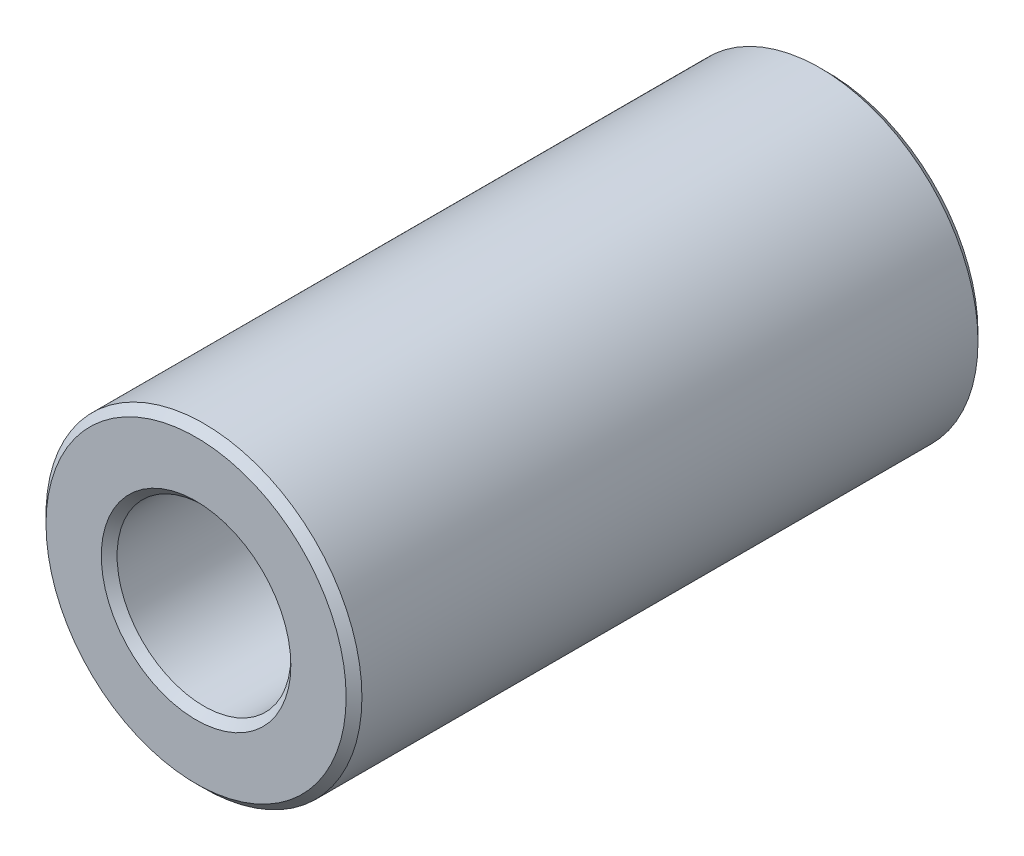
ISO-10303-21;
HEADER;
FILE_DESCRIPTION(('STEP AP214'),'2;1');
FILE_NAME('part.step','',(''),(''),'','','');
FILE_SCHEMA(('AUTOMOTIVE_DESIGN { 1 0 10303 214 1 1 1 1 }'));
ENDSEC;
DATA;
#1=APPLICATION_CONTEXT('core data for automotive mechanical design processes');
#2=APPLICATION_PROTOCOL_DEFINITION('international standard','automotive_design',2000,#1);
#3=PRODUCT_CONTEXT('',#1,'mechanical');
#4=PRODUCT('Part','Part','',(#3));
#5=PRODUCT_RELATED_PRODUCT_CATEGORY('part','',(#4));
#6=PRODUCT_DEFINITION_FORMATION('','',#4);
#7=PRODUCT_DEFINITION_CONTEXT('part definition',#1,'design');
#8=PRODUCT_DEFINITION('design','',#6,#7);
#9=PRODUCT_DEFINITION_SHAPE('','',#8);
#10=(LENGTH_UNIT() NAMED_UNIT(*) SI_UNIT(.MILLI.,.METRE.));
#11=(NAMED_UNIT(*) PLANE_ANGLE_UNIT() SI_UNIT($,.RADIAN.));
#12=(NAMED_UNIT(*) SI_UNIT($,.STERADIAN.) SOLID_ANGLE_UNIT());
#13=UNCERTAINTY_MEASURE_WITH_UNIT(LENGTH_MEASURE(1.E-05),#10,'distance_accuracy_value','');
#14=(GEOMETRIC_REPRESENTATION_CONTEXT(3) GLOBAL_UNCERTAINTY_ASSIGNED_CONTEXT((#13)) GLOBAL_UNIT_ASSIGNED_CONTEXT((#10,
#11,#12)) REPRESENTATION_CONTEXT('',''));
#15=CARTESIAN_POINT('',(0.,0.,0.));
#16=DIRECTION('',(0.,0.,1.));
#17=DIRECTION('',(1.,0.,0.));
#18=AXIS2_PLACEMENT_3D('',#15,#16,#17);
#19=CARTESIAN_POINT('',(0.,0.,4.));
#20=DIRECTION('',(0.,0.,1.));
#21=DIRECTION('',(1.,0.,0.));
#22=AXIS2_PLACEMENT_3D('',#19,#20,#21);
#23=PLANE('',#22);
#24=CARTESIAN_POINT('',(0.,0.,4.));
#25=DIRECTION('',(0.,0.,1.));
#26=DIRECTION('',(1.,0.,0.));
#27=AXIS2_PLACEMENT_3D('',#24,#25,#26);
#28=CIRCLE('',#27,1.2);
#29=CARTESIAN_POINT('',(1.2,0.,4.));
#30=VERTEX_POINT('',#29);
#31=EDGE_CURVE('E10',#30,#30,#28,.F.);
#32=ORIENTED_EDGE('',*,*,#31,.T.);
#33=EDGE_LOOP('',(#32));
#34=FACE_BOUND('',#33,.T.);
#35=CARTESIAN_POINT('',(0.,0.,4.));
#36=DIRECTION('',(0.,0.,1.));
#37=DIRECTION('',(1.,0.,0.));
#38=AXIS2_PLACEMENT_3D('',#35,#36,#37);
#39=CIRCLE('',#38,1.9);
#40=CARTESIAN_POINT('',(1.9,0.,4.));
#41=VERTEX_POINT('',#40);
#42=EDGE_CURVE('E45',#41,#41,#39,.T.);
#43=ORIENTED_EDGE('',*,*,#42,.T.);
#44=EDGE_LOOP('',(#43));
#45=FACE_BOUND('',#44,.T.);
#46=ADVANCED_FACE('F37',(#34,#45),#23,.T.);
#47=CARTESIAN_POINT('',(0.,0.,-4.));
#48=DIRECTION('',(0.,0.,1.));
#49=DIRECTION('',(1.,0.,0.));
#50=AXIS2_PLACEMENT_3D('',#47,#48,#49);
#51=PLANE('',#50);
#52=CARTESIAN_POINT('',(0.,0.,-4.));
#53=DIRECTION('',(0.,0.,1.));
#54=DIRECTION('',(1.,0.,0.));
#55=AXIS2_PLACEMENT_3D('',#52,#53,#54);
#56=CIRCLE('',#55,1.9);
#57=CARTESIAN_POINT('',(1.9,0.,-4.));
#58=VERTEX_POINT('',#57);
#59=EDGE_CURVE('E62',#58,#58,#56,.F.);
#60=ORIENTED_EDGE('',*,*,#59,.T.);
#61=EDGE_LOOP('',(#60));
#62=FACE_BOUND('',#61,.T.);
#63=CARTESIAN_POINT('',(0.,0.,-4.));
#64=DIRECTION('',(0.,0.,1.));
#65=DIRECTION('',(1.,0.,0.));
#66=AXIS2_PLACEMENT_3D('',#63,#64,#65);
#67=CIRCLE('',#66,1.2);
#68=CARTESIAN_POINT('',(1.2,0.,-4.));
#69=VERTEX_POINT('',#68);
#70=EDGE_CURVE('E66',#69,#69,#67,.T.);
#71=ORIENTED_EDGE('',*,*,#70,.T.);
#72=EDGE_LOOP('',(#71));
#73=FACE_BOUND('',#72,.T.);
#74=ADVANCED_FACE('F89',(#62,#73),#51,.F.);
#75=CARTESIAN_POINT('',(0.,0.,4.));
#76=DIRECTION('',(0.,0.,-1.));
#77=DIRECTION('',(-1.,0.,0.));
#78=AXIS2_PLACEMENT_3D('',#75,#76,#77);
#79=CYLINDRICAL_SURFACE('',#78,2.);
#80=CARTESIAN_POINT('',(0.,0.,-3.9));
#81=DIRECTION('',(0.,0.,1.));
#82=DIRECTION('',(1.,0.,0.));
#83=AXIS2_PLACEMENT_3D('',#80,#81,#82);
#84=CIRCLE('',#83,2.);
#85=CARTESIAN_POINT('',(2.,0.,-3.9));
#86=VERTEX_POINT('',#85);
#87=EDGE_CURVE('E70',#86,#86,#84,.T.);
#88=ORIENTED_EDGE('',*,*,#87,.T.);
#89=EDGE_LOOP('',(#88));
#90=FACE_BOUND('',#89,.T.);
#91=CARTESIAN_POINT('',(0.,0.,3.9));
#92=DIRECTION('',(0.,0.,1.));
#93=DIRECTION('',(1.,0.,0.));
#94=AXIS2_PLACEMENT_3D('',#91,#92,#93);
#95=CIRCLE('',#94,2.);
#96=CARTESIAN_POINT('',(2.,0.,3.9));
#97=VERTEX_POINT('',#96);
#98=EDGE_CURVE('E74',#97,#97,#95,.F.);
#99=ORIENTED_EDGE('',*,*,#98,.T.);
#100=EDGE_LOOP('',(#99));
#101=FACE_BOUND('',#100,.T.);
#102=ADVANCED_FACE('F78',(#90,#101),#79,.T.);
#103=CARTESIAN_POINT('',(0.,0.,4.));
#104=DIRECTION('',(0.,0.,-1.));
#105=DIRECTION('',(-1.,0.,0.));
#106=AXIS2_PLACEMENT_3D('',#103,#104,#105);
#107=CYLINDRICAL_SURFACE('',#106,1.1);
#108=CARTESIAN_POINT('',(0.,0.,-3.9));
#109=DIRECTION('',(0.,0.,1.));
#110=DIRECTION('',(1.,0.,0.));
#111=AXIS2_PLACEMENT_3D('',#108,#109,#110);
#112=CIRCLE('',#111,1.1);
#113=CARTESIAN_POINT('',(1.1,0.,-3.9));
#114=VERTEX_POINT('',#113);
#115=EDGE_CURVE('E51',#114,#114,#112,.F.);
#116=ORIENTED_EDGE('',*,*,#115,.T.);
#117=EDGE_LOOP('',(#116));
#118=FACE_BOUND('',#117,.T.);
#119=CARTESIAN_POINT('',(0.,0.,3.9));
#120=DIRECTION('',(0.,0.,1.));
#121=DIRECTION('',(1.,0.,0.));
#122=AXIS2_PLACEMENT_3D('',#119,#120,#121);
#123=CIRCLE('',#122,1.1);
#124=CARTESIAN_POINT('',(1.1,0.,3.9));
#125=VERTEX_POINT('',#124);
#126=EDGE_CURVE('E57',#125,#125,#123,.T.);
#127=ORIENTED_EDGE('',*,*,#126,.T.);
#128=EDGE_LOOP('',(#127));
#129=FACE_BOUND('',#128,.T.);
#130=ADVANCED_FACE('F97',(#118,#129),#107,.F.);
#131=CARTESIAN_POINT('',(0.,0.,-3.9));
#132=DIRECTION('',(0.,0.,1.));
#133=DIRECTION('',(1.,0.,0.));
#134=AXIS2_PLACEMENT_3D('',#131,#132,#133);
#135=CONICAL_SURFACE('',#134,2.,0.785398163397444);
#136=ORIENTED_EDGE('',*,*,#59,.F.);
#137=EDGE_LOOP('',(#136));
#138=FACE_BOUND('',#137,.T.);
#139=ORIENTED_EDGE('',*,*,#87,.F.);
#140=EDGE_LOOP('',(#139));
#141=FACE_BOUND('',#140,.T.);
#142=ADVANCED_FACE('F102',(#138,#141),#135,.T.);
#143=CARTESIAN_POINT('',(0.,0.,-4.));
#144=DIRECTION('',(0.,0.,-1.));
#145=DIRECTION('',(-1.,0.,0.));
#146=AXIS2_PLACEMENT_3D('',#143,#144,#145);
#147=CONICAL_SURFACE('',#146,1.2,0.785398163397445);
#148=ORIENTED_EDGE('',*,*,#115,.F.);
#149=EDGE_LOOP('',(#148));
#150=FACE_BOUND('',#149,.T.);
#151=ORIENTED_EDGE('',*,*,#70,.F.);
#152=EDGE_LOOP('',(#151));
#153=FACE_BOUND('',#152,.T.);
#154=ADVANCED_FACE('F86',(#150,#153),#147,.F.);
#155=CARTESIAN_POINT('',(0.,0.,3.9));
#156=DIRECTION('',(0.,0.,1.));
#157=DIRECTION('',(1.,0.,0.));
#158=AXIS2_PLACEMENT_3D('',#155,#156,#157);
#159=CONICAL_SURFACE('',#158,1.1,0.785398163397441);
#160=ORIENTED_EDGE('',*,*,#31,.F.);
#161=EDGE_LOOP('',(#160));
#162=FACE_BOUND('',#161,.T.);
#163=ORIENTED_EDGE('',*,*,#126,.F.);
#164=EDGE_LOOP('',(#163));
#165=FACE_BOUND('',#164,.T.);
#166=ADVANCED_FACE('F82',(#162,#165),#159,.F.);
#167=CARTESIAN_POINT('',(0.,0.,4.));
#168=DIRECTION('',(0.,0.,-1.));
#169=DIRECTION('',(-1.,0.,0.));
#170=AXIS2_PLACEMENT_3D('',#167,#168,#169);
#171=CONICAL_SURFACE('',#170,1.9,0.785398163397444);
#172=ORIENTED_EDGE('',*,*,#98,.F.);
#173=EDGE_LOOP('',(#172));
#174=FACE_BOUND('',#173,.T.);
#175=ORIENTED_EDGE('',*,*,#42,.F.);
#176=EDGE_LOOP('',(#175));
#177=FACE_BOUND('',#176,.T.);
#178=ADVANCED_FACE('F39',(#174,#177),#171,.T.);
#179=CLOSED_SHELL('',(#46,#74,#102,#130,#142,#154,#166,#178));
#180=MANIFOLD_SOLID_BREP('B2',#179);
#181=ADVANCED_BREP_SHAPE_REPRESENTATION('',(#18,#180),#14);
#182=SHAPE_DEFINITION_REPRESENTATION(#9,#181);
ENDSEC;
END-ISO-10303-21;
